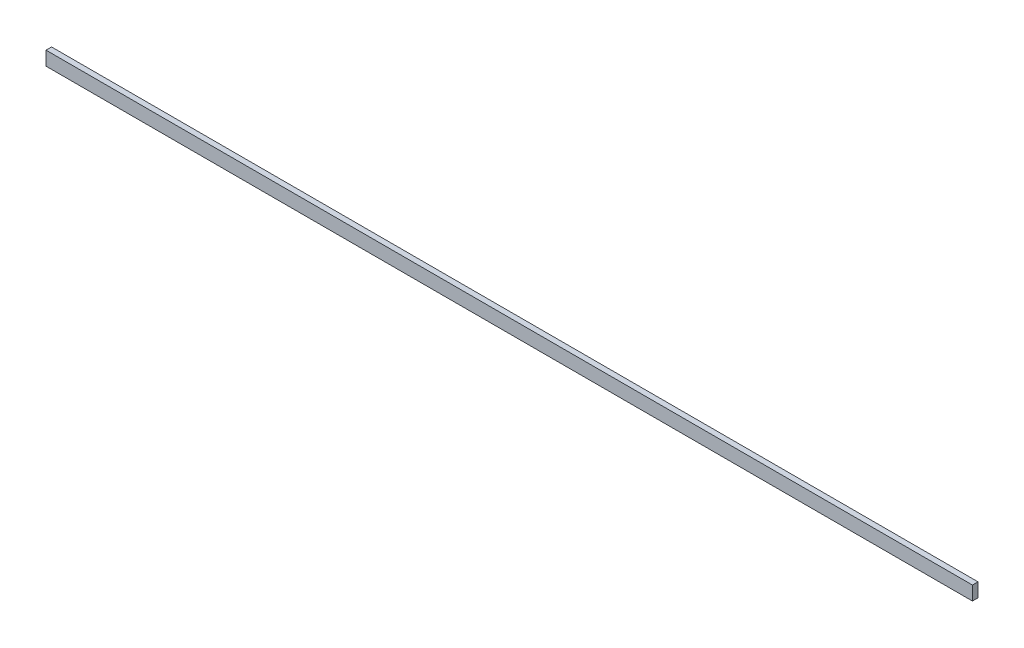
from build123d import *

# Parameters (mm, degrees)
SKETCH1_W           = 2000
SKETCH1_H           = 30
BOSS_EXTRUDE1_DEPTH = 12


with BuildPart() as part:
    # Sketch1 → Boss-Extrude1 (new body)
    with BuildSketch(Plane.XY):
        with Locations((1000, -15)):
            Rectangle(SKETCH1_W, SKETCH1_H)
    extrude(amount=BOSS_EXTRUDE1_DEPTH)


solid = part.part
